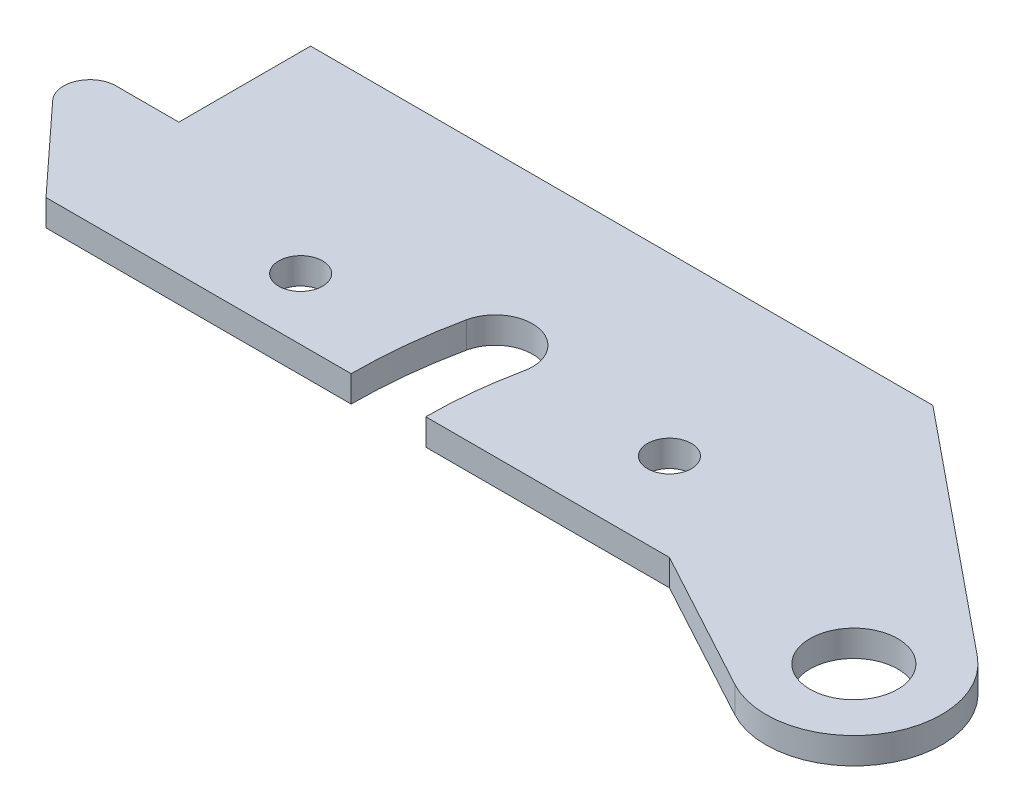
ISO-10303-21;
HEADER;
FILE_DESCRIPTION(('STEP AP214'),'2;1');
FILE_NAME('part.step','',(''),(''),'','','');
FILE_SCHEMA(('AUTOMOTIVE_DESIGN { 1 0 10303 214 1 1 1 1 }'));
ENDSEC;
DATA;
#1=APPLICATION_CONTEXT('core data for automotive mechanical design processes');
#2=APPLICATION_PROTOCOL_DEFINITION('international standard','automotive_design',2000,#1);
#3=PRODUCT_CONTEXT('',#1,'mechanical');
#4=PRODUCT('Part','Part','',(#3));
#5=PRODUCT_RELATED_PRODUCT_CATEGORY('part','',(#4));
#6=PRODUCT_DEFINITION_FORMATION('','',#4);
#7=PRODUCT_DEFINITION_CONTEXT('part definition',#1,'design');
#8=PRODUCT_DEFINITION('design','',#6,#7);
#9=PRODUCT_DEFINITION_SHAPE('','',#8);
#10=(LENGTH_UNIT() NAMED_UNIT(*) SI_UNIT(.MILLI.,.METRE.));
#11=(NAMED_UNIT(*) PLANE_ANGLE_UNIT() SI_UNIT($,.RADIAN.));
#12=(NAMED_UNIT(*) SI_UNIT($,.STERADIAN.) SOLID_ANGLE_UNIT());
#13=UNCERTAINTY_MEASURE_WITH_UNIT(LENGTH_MEASURE(1.E-05),#10,'distance_accuracy_value','');
#14=(GEOMETRIC_REPRESENTATION_CONTEXT(3) GLOBAL_UNCERTAINTY_ASSIGNED_CONTEXT((#13)) GLOBAL_UNIT_ASSIGNED_CONTEXT((#10,
#11,#12)) REPRESENTATION_CONTEXT('',''));
#15=CARTESIAN_POINT('',(0.,0.,0.));
#16=DIRECTION('',(0.,0.,1.));
#17=DIRECTION('',(1.,0.,0.));
#18=AXIS2_PLACEMENT_3D('',#15,#16,#17);
#19=CARTESIAN_POINT('',(-7.00000000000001,3.,-12.));
#20=DIRECTION('',(0.,1.,0.));
#21=DIRECTION('',(0.,0.,1.));
#22=AXIS2_PLACEMENT_3D('',#19,#20,#21);
#23=PLANE('',#22);
#24=CARTESIAN_POINT('',(22.,3.,-7.));
#25=DIRECTION('',(0.,1.,0.));
#26=DIRECTION('',(0.,0.,1.));
#27=AXIS2_PLACEMENT_3D('',#24,#25,#26);
#28=CIRCLE('',#27,2.49999999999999);
#29=CARTESIAN_POINT('',(22.,3.,-4.50000000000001));
#30=VERTEX_POINT('',#29);
#31=EDGE_CURVE('E291',#30,#30,#28,.T.);
#32=ORIENTED_EDGE('',*,*,#31,.F.);
#33=EDGE_LOOP('',(#32));
#34=FACE_BOUND('',#33,.T.);
#35=CARTESIAN_POINT('',(61.,3.,-10.));
#36=DIRECTION('',(0.,1.,0.));
#37=DIRECTION('',(0.,0.,1.));
#38=AXIS2_PLACEMENT_3D('',#35,#36,#37);
#39=CIRCLE('',#38,2.49999999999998);
#40=CARTESIAN_POINT('',(61.,3.,-7.50000000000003));
#41=VERTEX_POINT('',#40);
#42=EDGE_CURVE('E293',#41,#41,#39,.T.);
#43=ORIENTED_EDGE('',*,*,#42,.F.);
#44=EDGE_LOOP('',(#43));
#45=FACE_BOUND('',#44,.T.);
#46=DIRECTION('',(0.678510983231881,0.,0.734590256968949));
#47=VECTOR('',#46,1.);
#48=CARTESIAN_POINT('',(0.,3.,0.));
#49=LINE('',#48,#47);
#50=CARTESIAN_POINT('',(-9.20377077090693,3.,-9.96446705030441));
#51=VERTEX_POINT('',#50);
#52=CARTESIAN_POINT('',(0.,3.,0.));
#53=VERTEX_POINT('',#52);
#54=EDGE_CURVE('E182',#51,#53,#49,.T.);
#55=ORIENTED_EDGE('',*,*,#54,.T.);
#56=DIRECTION('',(1.,0.,0.));
#57=VECTOR('',#56,1.);
#58=CARTESIAN_POINT('',(0.,3.,0.));
#59=LINE('',#58,#57);
#60=CARTESIAN_POINT('',(34.75,3.,0.));
#61=VERTEX_POINT('',#60);
#62=EDGE_CURVE('E105',#53,#61,#59,.T.);
#63=ORIENTED_EDGE('',*,*,#62,.T.);
#64=CARTESIAN_POINT('',(92.,3.,0.));
#65=DIRECTION('',(0.,-1.,0.));
#66=DIRECTION('',(0.,0.,1.));
#67=AXIS2_PLACEMENT_3D('',#64,#65,#66);
#68=CIRCLE('',#67,57.25);
#69=CARTESIAN_POINT('',(35.9966181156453,3.,-11.8820754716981));
#70=VERTEX_POINT('',#69);
#71=EDGE_CURVE('E212',#61,#70,#68,.T.);
#72=ORIENTED_EDGE('',*,*,#71,.T.);
#73=CARTESIAN_POINT('',(40.1540744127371,3.,-11.));
#74=DIRECTION('',(0.,-1.,0.));
#75=DIRECTION('',(0.,0.,1.));
#76=AXIS2_PLACEMENT_3D('',#73,#74,#75);
#77=CIRCLE('',#76,4.25);
#78=CARTESIAN_POINT('',(44.311530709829,3.,-10.1179245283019));
#79=VERTEX_POINT('',#78);
#80=EDGE_CURVE('E231',#70,#79,#77,.T.);
#81=ORIENTED_EDGE('',*,*,#80,.T.);
#82=CARTESIAN_POINT('',(92.,3.,0.));
#83=DIRECTION('',(0.,1.,0.));
#84=DIRECTION('',(0.,0.,1.));
#85=AXIS2_PLACEMENT_3D('',#82,#83,#84);
#86=CIRCLE('',#85,48.75);
#87=CARTESIAN_POINT('',(43.25,3.,0.));
#88=VERTEX_POINT('',#87);
#89=EDGE_CURVE('E228',#79,#88,#86,.T.);
#90=ORIENTED_EDGE('',*,*,#89,.T.);
#91=DIRECTION('',(1.,0.,0.));
#92=VECTOR('',#91,1.);
#93=CARTESIAN_POINT('',(43.25,3.,0.));
#94=LINE('',#93,#92);
#95=CARTESIAN_POINT('',(71.,3.,0.));
#96=VERTEX_POINT('',#95);
#97=EDGE_CURVE('E230',#88,#96,#94,.T.);
#98=ORIENTED_EDGE('',*,*,#97,.T.);
#99=DIRECTION('',(0.879342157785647,0.,0.476190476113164));
#100=VECTOR('',#99,1.);
#101=CARTESIAN_POINT('',(71.,3.,0.));
#102=LINE('',#101,#100);
#103=CARTESIAN_POINT('',(87.2380952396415,3.,8.79342157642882));
#104=VERTEX_POINT('',#103);
#105=EDGE_CURVE('E233',#96,#104,#102,.T.);
#106=ORIENTED_EDGE('',*,*,#105,.T.);
#107=CARTESIAN_POINT('',(92.,3.,0.));
#108=DIRECTION('',(0.,1.,0.));
#109=DIRECTION('',(0.,0.,1.));
#110=AXIS2_PLACEMENT_3D('',#107,#108,#109);
#111=CIRCLE('',#110,9.99999999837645);
#112=CARTESIAN_POINT('',(98.3149507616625,3.,-7.75379886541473));
#113=VERTEX_POINT('',#112);
#114=EDGE_CURVE('E239',#104,#113,#111,.T.);
#115=ORIENTED_EDGE('',*,*,#114,.T.);
#116=DIRECTION('',(-0.775379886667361,0.,-0.631495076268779));
#117=VECTOR('',#116,1.);
#118=CARTESIAN_POINT('',(71.,3.,-30.));
#119=LINE('',#118,#117);
#120=CARTESIAN_POINT('',(71.,3.,-30.));
#121=VERTEX_POINT('',#120);
#122=EDGE_CURVE('E241',#113,#121,#119,.T.);
#123=ORIENTED_EDGE('',*,*,#122,.T.);
#124=DIRECTION('',(-1.,0.,0.));
#125=VECTOR('',#124,1.);
#126=CARTESIAN_POINT('',(0.130422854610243,3.,-30.));
#127=LINE('',#126,#125);
#128=CARTESIAN_POINT('',(0.130422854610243,3.,-30.));
#129=VERTEX_POINT('',#128);
#130=EDGE_CURVE('E139',#121,#129,#127,.T.);
#131=ORIENTED_EDGE('',*,*,#130,.T.);
#132=DIRECTION('',(0.,0.,1.));
#133=VECTOR('',#132,1.);
#134=CARTESIAN_POINT('',(0.130422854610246,3.,-14.9971636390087));
#135=LINE('',#134,#133);
#136=CARTESIAN_POINT('',(0.130422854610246,3.,-14.9971636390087));
#137=VERTEX_POINT('',#136);
#138=EDGE_CURVE('E133',#129,#137,#135,.T.);
#139=ORIENTED_EDGE('',*,*,#138,.T.);
#140=DIRECTION('',(-1.,0.,0.));
#141=VECTOR('',#140,1.);
#142=CARTESIAN_POINT('',(-6.86957714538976,3.,-14.9971636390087));
#143=LINE('',#142,#141);
#144=CARTESIAN_POINT('',(-6.86957714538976,3.,-14.9971636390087));
#145=VERTEX_POINT('',#144);
#146=EDGE_CURVE('E137',#137,#145,#143,.T.);
#147=ORIENTED_EDGE('',*,*,#146,.T.);
#148=CARTESIAN_POINT('',(-7.00000000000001,3.,-12.));
#149=DIRECTION('',(0.,1.,0.));
#150=DIRECTION('',(0.,0.,1.));
#151=AXIS2_PLACEMENT_3D('',#148,#149,#150);
#152=CIRCLE('',#151,3.00000000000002);
#153=EDGE_CURVE('E47',#145,#51,#152,.T.);
#154=ORIENTED_EDGE('',*,*,#153,.T.);
#155=EDGE_LOOP('',(#55,#63,#72,#81,#90,#98,#106,#115,#123,#131,#139,#147,#154));
#156=FACE_BOUND('',#155,.T.);
#157=CARTESIAN_POINT('',(92.,3.,0.));
#158=DIRECTION('',(0.,1.,0.));
#159=DIRECTION('',(0.,0.,1.));
#160=AXIS2_PLACEMENT_3D('',#157,#158,#159);
#161=CIRCLE('',#160,5.);
#162=CARTESIAN_POINT('',(92.,3.,5.));
#163=VERTEX_POINT('',#162);
#164=EDGE_CURVE('E161',#163,#163,#161,.T.);
#165=ORIENTED_EDGE('',*,*,#164,.F.);
#166=EDGE_LOOP('',(#165));
#167=FACE_BOUND('',#166,.T.);
#168=ADVANCED_FACE('F30',(#34,#45,#156,#167),#23,.T.);
#169=CARTESIAN_POINT('',(-7.00000000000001,0.,-12.));
#170=DIRECTION('',(0.,1.,0.));
#171=DIRECTION('',(0.,0.,1.));
#172=AXIS2_PLACEMENT_3D('',#169,#170,#171);
#173=PLANE('',#172);
#174=CARTESIAN_POINT('',(22.,0.,-7.));
#175=DIRECTION('',(0.,1.,0.));
#176=DIRECTION('',(0.,0.,1.));
#177=AXIS2_PLACEMENT_3D('',#174,#175,#176);
#178=CIRCLE('',#177,2.5);
#179=CARTESIAN_POINT('',(22.,0.,-4.5));
#180=VERTEX_POINT('',#179);
#181=EDGE_CURVE('E289',#180,#180,#178,.T.);
#182=ORIENTED_EDGE('',*,*,#181,.T.);
#183=EDGE_LOOP('',(#182));
#184=FACE_BOUND('',#183,.T.);
#185=CARTESIAN_POINT('',(61.,0.,-10.));
#186=DIRECTION('',(0.,1.,0.));
#187=DIRECTION('',(0.,0.,1.));
#188=AXIS2_PLACEMENT_3D('',#185,#186,#187);
#189=CIRCLE('',#188,2.5);
#190=CARTESIAN_POINT('',(61.,0.,-7.50000000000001));
#191=VERTEX_POINT('',#190);
#192=EDGE_CURVE('E298',#191,#191,#189,.T.);
#193=ORIENTED_EDGE('',*,*,#192,.T.);
#194=EDGE_LOOP('',(#193));
#195=FACE_BOUND('',#194,.T.);
#196=DIRECTION('',(0.678510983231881,0.,0.734590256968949));
#197=VECTOR('',#196,1.);
#198=CARTESIAN_POINT('',(0.,0.,0.));
#199=LINE('',#198,#197);
#200=CARTESIAN_POINT('',(-9.20377077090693,0.,-9.96446705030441));
#201=VERTEX_POINT('',#200);
#202=CARTESIAN_POINT('',(0.,0.,0.));
#203=VERTEX_POINT('',#202);
#204=EDGE_CURVE('E157',#201,#203,#199,.T.);
#205=ORIENTED_EDGE('',*,*,#204,.F.);
#206=CARTESIAN_POINT('',(-7.00000000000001,0.,-12.));
#207=DIRECTION('',(0.,1.,0.));
#208=DIRECTION('',(0.,0.,1.));
#209=AXIS2_PLACEMENT_3D('',#206,#207,#208);
#210=CIRCLE('',#209,3.00000000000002);
#211=CARTESIAN_POINT('',(-6.86957714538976,0.,-14.9971636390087));
#212=VERTEX_POINT('',#211);
#213=EDGE_CURVE('E97',#212,#201,#210,.T.);
#214=ORIENTED_EDGE('',*,*,#213,.F.);
#215=DIRECTION('',(-1.,0.,0.));
#216=VECTOR('',#215,1.);
#217=CARTESIAN_POINT('',(-6.86957714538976,0.,-14.9971636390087));
#218=LINE('',#217,#216);
#219=CARTESIAN_POINT('',(0.130422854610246,0.,-14.9971636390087));
#220=VERTEX_POINT('',#219);
#221=EDGE_CURVE('E91',#220,#212,#218,.T.);
#222=ORIENTED_EDGE('',*,*,#221,.F.);
#223=DIRECTION('',(0.,0.,1.));
#224=VECTOR('',#223,1.);
#225=CARTESIAN_POINT('',(0.130422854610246,0.,-14.9971636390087));
#226=LINE('',#225,#224);
#227=CARTESIAN_POINT('',(0.130422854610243,0.,-30.));
#228=VERTEX_POINT('',#227);
#229=EDGE_CURVE('E147',#228,#220,#226,.T.);
#230=ORIENTED_EDGE('',*,*,#229,.F.);
#231=DIRECTION('',(-1.,0.,0.));
#232=VECTOR('',#231,1.);
#233=CARTESIAN_POINT('',(0.130422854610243,0.,-30.));
#234=LINE('',#233,#232);
#235=CARTESIAN_POINT('',(71.,0.,-30.));
#236=VERTEX_POINT('',#235);
#237=EDGE_CURVE('E177',#236,#228,#234,.T.);
#238=ORIENTED_EDGE('',*,*,#237,.F.);
#239=DIRECTION('',(-0.775379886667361,0.,-0.631495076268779));
#240=VECTOR('',#239,1.);
#241=CARTESIAN_POINT('',(71.,0.,-30.));
#242=LINE('',#241,#240);
#243=CARTESIAN_POINT('',(98.3149507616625,0.,-7.75379886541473));
#244=VERTEX_POINT('',#243);
#245=EDGE_CURVE('E175',#244,#236,#242,.T.);
#246=ORIENTED_EDGE('',*,*,#245,.F.);
#247=CARTESIAN_POINT('',(92.,0.,0.));
#248=DIRECTION('',(0.,1.,0.));
#249=DIRECTION('',(0.,0.,1.));
#250=AXIS2_PLACEMENT_3D('',#247,#248,#249);
#251=CIRCLE('',#250,9.99999999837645);
#252=CARTESIAN_POINT('',(87.2380952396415,0.,8.79342157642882));
#253=VERTEX_POINT('',#252);
#254=EDGE_CURVE('E173',#253,#244,#251,.T.);
#255=ORIENTED_EDGE('',*,*,#254,.F.);
#256=DIRECTION('',(0.879342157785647,0.,0.476190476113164));
#257=VECTOR('',#256,1.);
#258=CARTESIAN_POINT('',(71.,0.,0.));
#259=LINE('',#258,#257);
#260=CARTESIAN_POINT('',(71.,0.,0.));
#261=VERTEX_POINT('',#260);
#262=EDGE_CURVE('E171',#261,#253,#259,.T.);
#263=ORIENTED_EDGE('',*,*,#262,.F.);
#264=DIRECTION('',(1.,0.,0.));
#265=VECTOR('',#264,1.);
#266=CARTESIAN_POINT('',(43.25,0.,0.));
#267=LINE('',#266,#265);
#268=CARTESIAN_POINT('',(43.25,0.,0.));
#269=VERTEX_POINT('',#268);
#270=EDGE_CURVE('E169',#269,#261,#267,.T.);
#271=ORIENTED_EDGE('',*,*,#270,.F.);
#272=CARTESIAN_POINT('',(92.,0.,0.));
#273=DIRECTION('',(0.,1.,0.));
#274=DIRECTION('',(0.,0.,1.));
#275=AXIS2_PLACEMENT_3D('',#272,#273,#274);
#276=CIRCLE('',#275,48.75);
#277=CARTESIAN_POINT('',(44.311530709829,0.,-10.1179245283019));
#278=VERTEX_POINT('',#277);
#279=EDGE_CURVE('E167',#278,#269,#276,.T.);
#280=ORIENTED_EDGE('',*,*,#279,.F.);
#281=CARTESIAN_POINT('',(40.1540744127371,0.,-11.));
#282=DIRECTION('',(0.,-1.,0.));
#283=DIRECTION('',(0.,0.,1.));
#284=AXIS2_PLACEMENT_3D('',#281,#282,#283);
#285=CIRCLE('',#284,4.25);
#286=CARTESIAN_POINT('',(35.9966181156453,0.,-11.8820754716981));
#287=VERTEX_POINT('',#286);
#288=EDGE_CURVE('E165',#287,#278,#285,.T.);
#289=ORIENTED_EDGE('',*,*,#288,.F.);
#290=CARTESIAN_POINT('',(92.,0.,0.));
#291=DIRECTION('',(0.,-1.,0.));
#292=DIRECTION('',(0.,0.,1.));
#293=AXIS2_PLACEMENT_3D('',#290,#291,#292);
#294=CIRCLE('',#293,57.25);
#295=CARTESIAN_POINT('',(34.75,0.,0.));
#296=VERTEX_POINT('',#295);
#297=EDGE_CURVE('E163',#296,#287,#294,.T.);
#298=ORIENTED_EDGE('',*,*,#297,.F.);
#299=DIRECTION('',(1.,0.,0.));
#300=VECTOR('',#299,1.);
#301=CARTESIAN_POINT('',(0.,0.,0.));
#302=LINE('',#301,#300);
#303=EDGE_CURVE('E160',#203,#296,#302,.T.);
#304=ORIENTED_EDGE('',*,*,#303,.F.);
#305=EDGE_LOOP('',(#205,#214,#222,#230,#238,#246,#255,#263,#271,#280,#289,#298,#304));
#306=FACE_BOUND('',#305,.T.);
#307=CARTESIAN_POINT('',(92.,0.,0.));
#308=DIRECTION('',(0.,1.,0.));
#309=DIRECTION('',(0.,0.,1.));
#310=AXIS2_PLACEMENT_3D('',#307,#308,#309);
#311=CIRCLE('',#310,5.);
#312=CARTESIAN_POINT('',(92.,0.,5.));
#313=VERTEX_POINT('',#312);
#314=EDGE_CURVE('E301',#313,#313,#311,.T.);
#315=ORIENTED_EDGE('',*,*,#314,.T.);
#316=EDGE_LOOP('',(#315));
#317=FACE_BOUND('',#316,.T.);
#318=ADVANCED_FACE('F216',(#184,#195,#306,#317),#173,.F.);
#319=CARTESIAN_POINT('',(0.,3.,0.));
#320=DIRECTION('',(0.734590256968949,0.,-0.678510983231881));
#321=DIRECTION('',(-0.678510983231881,0.,-0.734590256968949));
#322=AXIS2_PLACEMENT_3D('',#319,#320,#321);
#323=PLANE('',#322);
#324=ORIENTED_EDGE('',*,*,#204,.T.);
#325=DIRECTION('',(0.,-1.,0.));
#326=VECTOR('',#325,1.);
#327=CARTESIAN_POINT('',(0.,3.,0.));
#328=LINE('',#327,#326);
#329=EDGE_CURVE('E11',#53,#203,#328,.T.);
#330=ORIENTED_EDGE('',*,*,#329,.F.);
#331=ORIENTED_EDGE('',*,*,#54,.F.);
#332=DIRECTION('',(0.,-1.,0.));
#333=VECTOR('',#332,1.);
#334=CARTESIAN_POINT('',(-9.20377077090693,3.,-9.96446705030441));
#335=LINE('',#334,#333);
#336=EDGE_CURVE('E153',#51,#201,#335,.T.);
#337=ORIENTED_EDGE('',*,*,#336,.T.);
#338=EDGE_LOOP('',(#324,#330,#331,#337));
#339=FACE_BOUND('',#338,.T.);
#340=ADVANCED_FACE('F32',(#339),#323,.F.);
#341=CARTESIAN_POINT('',(0.,3.,0.));
#342=DIRECTION('',(0.,0.,-1.));
#343=DIRECTION('',(-1.,0.,0.));
#344=AXIS2_PLACEMENT_3D('',#341,#342,#343);
#345=PLANE('',#344);
#346=ORIENTED_EDGE('',*,*,#303,.T.);
#347=DIRECTION('',(0.,-1.,0.));
#348=VECTOR('',#347,1.);
#349=CARTESIAN_POINT('',(34.75,3.,0.));
#350=LINE('',#349,#348);
#351=EDGE_CURVE('E39',#61,#296,#350,.T.);
#352=ORIENTED_EDGE('',*,*,#351,.F.);
#353=ORIENTED_EDGE('',*,*,#62,.F.);
#354=ORIENTED_EDGE('',*,*,#329,.T.);
#355=EDGE_LOOP('',(#346,#352,#353,#354));
#356=FACE_BOUND('',#355,.T.);
#357=ADVANCED_FACE('F344',(#356),#345,.F.);
#358=CARTESIAN_POINT('',(92.,3.,0.));
#359=DIRECTION('',(0.,-1.,0.));
#360=DIRECTION('',(0.,0.,-1.));
#361=AXIS2_PLACEMENT_3D('',#358,#359,#360);
#362=CYLINDRICAL_SURFACE('',#361,57.25);
#363=ORIENTED_EDGE('',*,*,#297,.T.);
#364=DIRECTION('',(0.,-1.,0.));
#365=VECTOR('',#364,1.);
#366=CARTESIAN_POINT('',(35.9966181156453,3.,-11.8820754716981));
#367=LINE('',#366,#365);
#368=EDGE_CURVE('E204',#70,#287,#367,.T.);
#369=ORIENTED_EDGE('',*,*,#368,.F.);
#370=ORIENTED_EDGE('',*,*,#71,.F.);
#371=ORIENTED_EDGE('',*,*,#351,.T.);
#372=EDGE_LOOP('',(#363,#369,#370,#371));
#373=FACE_BOUND('',#372,.T.);
#374=ADVANCED_FACE('F210',(#373),#362,.F.);
#375=CARTESIAN_POINT('',(40.1540744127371,3.,-11.));
#376=DIRECTION('',(0.,-1.,0.));
#377=DIRECTION('',(0.,0.,-1.));
#378=AXIS2_PLACEMENT_3D('',#375,#376,#377);
#379=CYLINDRICAL_SURFACE('',#378,4.25);
#380=ORIENTED_EDGE('',*,*,#288,.T.);
#381=DIRECTION('',(0.,-1.,0.));
#382=VECTOR('',#381,1.);
#383=CARTESIAN_POINT('',(44.311530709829,3.,-10.1179245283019));
#384=LINE('',#383,#382);
#385=EDGE_CURVE('E201',#79,#278,#384,.T.);
#386=ORIENTED_EDGE('',*,*,#385,.F.);
#387=ORIENTED_EDGE('',*,*,#80,.F.);
#388=ORIENTED_EDGE('',*,*,#368,.T.);
#389=EDGE_LOOP('',(#380,#386,#387,#388));
#390=FACE_BOUND('',#389,.T.);
#391=ADVANCED_FACE('F222',(#390),#379,.F.);
#392=CARTESIAN_POINT('',(92.,3.,0.));
#393=DIRECTION('',(0.,-1.,0.));
#394=DIRECTION('',(0.,0.,-1.));
#395=AXIS2_PLACEMENT_3D('',#392,#393,#394);
#396=CYLINDRICAL_SURFACE('',#395,48.75);
#397=ORIENTED_EDGE('',*,*,#279,.T.);
#398=DIRECTION('',(0.,-1.,0.));
#399=VECTOR('',#398,1.);
#400=CARTESIAN_POINT('',(43.25,3.,0.));
#401=LINE('',#400,#399);
#402=EDGE_CURVE('E198',#88,#269,#401,.T.);
#403=ORIENTED_EDGE('',*,*,#402,.F.);
#404=ORIENTED_EDGE('',*,*,#89,.F.);
#405=ORIENTED_EDGE('',*,*,#385,.T.);
#406=EDGE_LOOP('',(#397,#403,#404,#405));
#407=FACE_BOUND('',#406,.T.);
#408=ADVANCED_FACE('F226',(#407),#396,.T.);
#409=CARTESIAN_POINT('',(43.25,3.,0.));
#410=DIRECTION('',(0.,0.,-1.));
#411=DIRECTION('',(-1.,0.,0.));
#412=AXIS2_PLACEMENT_3D('',#409,#410,#411);
#413=PLANE('',#412);
#414=ORIENTED_EDGE('',*,*,#270,.T.);
#415=DIRECTION('',(0.,-1.,0.));
#416=VECTOR('',#415,1.);
#417=CARTESIAN_POINT('',(71.,3.,0.));
#418=LINE('',#417,#416);
#419=EDGE_CURVE('E195',#96,#261,#418,.T.);
#420=ORIENTED_EDGE('',*,*,#419,.F.);
#421=ORIENTED_EDGE('',*,*,#97,.F.);
#422=ORIENTED_EDGE('',*,*,#402,.T.);
#423=EDGE_LOOP('',(#414,#420,#421,#422));
#424=FACE_BOUND('',#423,.T.);
#425=ADVANCED_FACE('F366',(#424),#413,.F.);
#426=CARTESIAN_POINT('',(71.,3.,0.));
#427=DIRECTION('',(0.476190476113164,0.,-0.879342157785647));
#428=DIRECTION('',(-0.879342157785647,0.,-0.476190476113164));
#429=AXIS2_PLACEMENT_3D('',#426,#427,#428);
#430=PLANE('',#429);
#431=ORIENTED_EDGE('',*,*,#262,.T.);
#432=DIRECTION('',(0.,-1.,0.));
#433=VECTOR('',#432,1.);
#434=CARTESIAN_POINT('',(87.2380952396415,3.,8.79342157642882));
#435=LINE('',#434,#433);
#436=EDGE_CURVE('E192',#104,#253,#435,.T.);
#437=ORIENTED_EDGE('',*,*,#436,.F.);
#438=ORIENTED_EDGE('',*,*,#105,.F.);
#439=ORIENTED_EDGE('',*,*,#419,.T.);
#440=EDGE_LOOP('',(#431,#437,#438,#439));
#441=FACE_BOUND('',#440,.T.);
#442=ADVANCED_FACE('F373',(#441),#430,.F.);
#443=CARTESIAN_POINT('',(92.,3.,0.));
#444=DIRECTION('',(0.,-1.,0.));
#445=DIRECTION('',(0.,0.,-1.));
#446=AXIS2_PLACEMENT_3D('',#443,#444,#445);
#447=CYLINDRICAL_SURFACE('',#446,9.99999999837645);
#448=ORIENTED_EDGE('',*,*,#254,.T.);
#449=DIRECTION('',(0.,-1.,0.));
#450=VECTOR('',#449,1.);
#451=CARTESIAN_POINT('',(98.3149507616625,3.,-7.75379886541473));
#452=LINE('',#451,#450);
#453=EDGE_CURVE('E189',#113,#244,#452,.T.);
#454=ORIENTED_EDGE('',*,*,#453,.F.);
#455=ORIENTED_EDGE('',*,*,#114,.F.);
#456=ORIENTED_EDGE('',*,*,#436,.T.);
#457=EDGE_LOOP('',(#448,#454,#455,#456));
#458=FACE_BOUND('',#457,.T.);
#459=ADVANCED_FACE('F381',(#458),#447,.T.);
#460=CARTESIAN_POINT('',(71.,3.,-30.));
#461=DIRECTION('',(-0.631495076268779,0.,0.77537988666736));
#462=DIRECTION('',(0.775379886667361,0.,0.631495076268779));
#463=AXIS2_PLACEMENT_3D('',#460,#461,#462);
#464=PLANE('',#463);
#465=ORIENTED_EDGE('',*,*,#245,.T.);
#466=DIRECTION('',(0.,-1.,0.));
#467=VECTOR('',#466,1.);
#468=CARTESIAN_POINT('',(71.,3.,-30.));
#469=LINE('',#468,#467);
#470=EDGE_CURVE('E186',#121,#236,#469,.T.);
#471=ORIENTED_EDGE('',*,*,#470,.F.);
#472=ORIENTED_EDGE('',*,*,#122,.F.);
#473=ORIENTED_EDGE('',*,*,#453,.T.);
#474=EDGE_LOOP('',(#465,#471,#472,#473));
#475=FACE_BOUND('',#474,.T.);
#476=ADVANCED_FACE('F247',(#475),#464,.F.);
#477=CARTESIAN_POINT('',(0.130422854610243,3.,-30.));
#478=DIRECTION('',(0.,0.,1.));
#479=DIRECTION('',(1.,0.,0.));
#480=AXIS2_PLACEMENT_3D('',#477,#478,#479);
#481=PLANE('',#480);
#482=ORIENTED_EDGE('',*,*,#237,.T.);
#483=DIRECTION('',(0.,-1.,0.));
#484=VECTOR('',#483,1.);
#485=CARTESIAN_POINT('',(0.130422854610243,3.,-30.));
#486=LINE('',#485,#484);
#487=EDGE_CURVE('E148',#129,#228,#486,.T.);
#488=ORIENTED_EDGE('',*,*,#487,.F.);
#489=ORIENTED_EDGE('',*,*,#130,.F.);
#490=ORIENTED_EDGE('',*,*,#470,.T.);
#491=EDGE_LOOP('',(#482,#488,#489,#490));
#492=FACE_BOUND('',#491,.T.);
#493=ADVANCED_FACE('F251',(#492),#481,.F.);
#494=CARTESIAN_POINT('',(0.130422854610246,3.,-14.9971636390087));
#495=DIRECTION('',(1.,0.,0.));
#496=DIRECTION('',(0.,0.,-1.));
#497=AXIS2_PLACEMENT_3D('',#494,#495,#496);
#498=PLANE('',#497);
#499=ORIENTED_EDGE('',*,*,#229,.T.);
#500=DIRECTION('',(0.,-1.,0.));
#501=VECTOR('',#500,1.);
#502=CARTESIAN_POINT('',(0.130422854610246,3.,-14.9971636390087));
#503=LINE('',#502,#501);
#504=EDGE_CURVE('E144',#137,#220,#503,.T.);
#505=ORIENTED_EDGE('',*,*,#504,.F.);
#506=ORIENTED_EDGE('',*,*,#138,.F.);
#507=ORIENTED_EDGE('',*,*,#487,.T.);
#508=EDGE_LOOP('',(#499,#505,#506,#507));
#509=FACE_BOUND('',#508,.T.);
#510=ADVANCED_FACE('F145',(#509),#498,.F.);
#511=CARTESIAN_POINT('',(-6.86957714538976,3.,-14.9971636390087));
#512=DIRECTION('',(0.,0.,1.));
#513=DIRECTION('',(1.,0.,0.));
#514=AXIS2_PLACEMENT_3D('',#511,#512,#513);
#515=PLANE('',#514);
#516=ORIENTED_EDGE('',*,*,#221,.T.);
#517=DIRECTION('',(0.,-1.,0.));
#518=VECTOR('',#517,1.);
#519=CARTESIAN_POINT('',(-6.86957714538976,3.,-14.9971636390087));
#520=LINE('',#519,#518);
#521=EDGE_CURVE('E149',#145,#212,#520,.T.);
#522=ORIENTED_EDGE('',*,*,#521,.F.);
#523=ORIENTED_EDGE('',*,*,#146,.F.);
#524=ORIENTED_EDGE('',*,*,#504,.T.);
#525=EDGE_LOOP('',(#516,#522,#523,#524));
#526=FACE_BOUND('',#525,.T.);
#527=ADVANCED_FACE('F151',(#526),#515,.F.);
#528=CARTESIAN_POINT('',(-7.00000000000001,3.,-12.));
#529=DIRECTION('',(0.,-1.,0.));
#530=DIRECTION('',(0.,0.,-1.));
#531=AXIS2_PLACEMENT_3D('',#528,#529,#530);
#532=CYLINDRICAL_SURFACE('',#531,3.00000000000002);
#533=ORIENTED_EDGE('',*,*,#213,.T.);
#534=ORIENTED_EDGE('',*,*,#336,.F.);
#535=ORIENTED_EDGE('',*,*,#153,.F.);
#536=ORIENTED_EDGE('',*,*,#521,.T.);
#537=EDGE_LOOP('',(#533,#534,#535,#536));
#538=FACE_BOUND('',#537,.T.);
#539=ADVANCED_FACE('F255',(#538),#532,.T.);
#540=CARTESIAN_POINT('',(92.,3.,0.));
#541=DIRECTION('',(0.,-1.,0.));
#542=DIRECTION('',(0.,0.,-1.));
#543=AXIS2_PLACEMENT_3D('',#540,#541,#542);
#544=CYLINDRICAL_SURFACE('',#543,5.);
#545=ORIENTED_EDGE('',*,*,#164,.T.);
#546=EDGE_LOOP('',(#545));
#547=FACE_BOUND('',#546,.T.);
#548=ORIENTED_EDGE('',*,*,#314,.F.);
#549=EDGE_LOOP('',(#548));
#550=FACE_BOUND('',#549,.T.);
#551=ADVANCED_FACE('F257',(#547,#550),#544,.F.);
#552=CARTESIAN_POINT('',(61.,3.,-10.));
#553=DIRECTION('',(0.,1.,0.));
#554=DIRECTION('',(0.,0.,1.));
#555=AXIS2_PLACEMENT_3D('',#552,#553,#554);
#556=CYLINDRICAL_SURFACE('',#555,2.49999999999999);
#557=ORIENTED_EDGE('',*,*,#192,.F.);
#558=EDGE_LOOP('',(#557));
#559=FACE_BOUND('',#558,.T.);
#560=ORIENTED_EDGE('',*,*,#42,.T.);
#561=EDGE_LOOP('',(#560));
#562=FACE_BOUND('',#561,.T.);
#563=ADVANCED_FACE('F263',(#559,#562),#556,.F.);
#564=CARTESIAN_POINT('',(22.,3.,-7.));
#565=DIRECTION('',(0.,1.,0.));
#566=DIRECTION('',(0.,0.,1.));
#567=AXIS2_PLACEMENT_3D('',#564,#565,#566);
#568=CYLINDRICAL_SURFACE('',#567,2.49999999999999);
#569=ORIENTED_EDGE('',*,*,#181,.F.);
#570=EDGE_LOOP('',(#569));
#571=FACE_BOUND('',#570,.T.);
#572=ORIENTED_EDGE('',*,*,#31,.T.);
#573=EDGE_LOOP('',(#572));
#574=FACE_BOUND('',#573,.T.);
#575=ADVANCED_FACE('F280',(#571,#574),#568,.F.);
#576=CLOSED_SHELL('',(#168,#318,#340,#357,#374,#391,#408,#425,#442,#459,#476,#493,#510,#527,
#539,#551,#563,#575));
#577=MANIFOLD_SOLID_BREP('B2',#576);
#578=ADVANCED_BREP_SHAPE_REPRESENTATION('',(#18,#577),#14);
#579=SHAPE_DEFINITION_REPRESENTATION(#9,#578);
ENDSEC;
END-ISO-10303-21;
